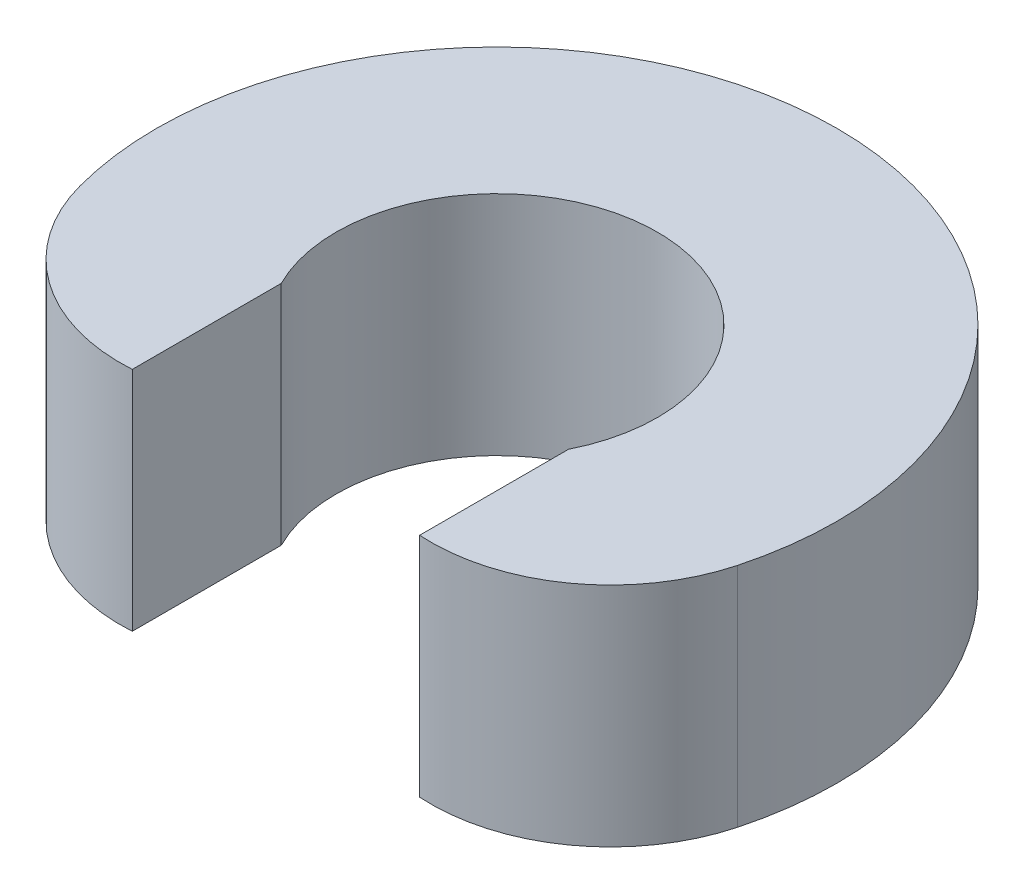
ISO-10303-21;
HEADER;
FILE_DESCRIPTION(('STEP AP214'),'2;1');
FILE_NAME('part.step','',(''),(''),'','','');
FILE_SCHEMA(('AUTOMOTIVE_DESIGN { 1 0 10303 214 1 1 1 1 }'));
ENDSEC;
DATA;
#1=APPLICATION_CONTEXT('core data for automotive mechanical design processes');
#2=APPLICATION_PROTOCOL_DEFINITION('international standard','automotive_design',2000,#1);
#3=PRODUCT_CONTEXT('',#1,'mechanical');
#4=PRODUCT('Part','Part','',(#3));
#5=PRODUCT_RELATED_PRODUCT_CATEGORY('part','',(#4));
#6=PRODUCT_DEFINITION_FORMATION('','',#4);
#7=PRODUCT_DEFINITION_CONTEXT('part definition',#1,'design');
#8=PRODUCT_DEFINITION('design','',#6,#7);
#9=PRODUCT_DEFINITION_SHAPE('','',#8);
#10=(LENGTH_UNIT() NAMED_UNIT(*) SI_UNIT(.MILLI.,.METRE.));
#11=(NAMED_UNIT(*) PLANE_ANGLE_UNIT() SI_UNIT($,.RADIAN.));
#12=(NAMED_UNIT(*) SI_UNIT($,.STERADIAN.) SOLID_ANGLE_UNIT());
#13=UNCERTAINTY_MEASURE_WITH_UNIT(LENGTH_MEASURE(1.E-05),#10,'distance_accuracy_value','');
#14=(GEOMETRIC_REPRESENTATION_CONTEXT(3) GLOBAL_UNCERTAINTY_ASSIGNED_CONTEXT((#13)) GLOBAL_UNIT_ASSIGNED_CONTEXT((#10,
#11,#12)) REPRESENTATION_CONTEXT('',''));
#15=CARTESIAN_POINT('',(0.,0.,0.));
#16=DIRECTION('',(0.,0.,1.));
#17=DIRECTION('',(1.,0.,0.));
#18=AXIS2_PLACEMENT_3D('',#15,#16,#17);
#19=CARTESIAN_POINT('',(190.,300.,400.));
#20=DIRECTION('',(-1.,0.,0.));
#21=DIRECTION('',(0.,0.,1.));
#22=AXIS2_PLACEMENT_3D('',#19,#20,#21);
#23=PLANE('',#22);
#24=DIRECTION('',(0.,1.,0.));
#25=VECTOR('',#24,1.);
#26=CARTESIAN_POINT('',(190.,300.,292.034677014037));
#27=LINE('',#26,#25);
#28=CARTESIAN_POINT('',(190.,0.,292.034677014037));
#29=VERTEX_POINT('',#28);
#30=CARTESIAN_POINT('',(190.,300.,292.034677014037));
#31=VERTEX_POINT('',#30);
#32=EDGE_CURVE('E10',#29,#31,#27,.T.);
#33=ORIENTED_EDGE('',*,*,#32,.T.);
#34=DIRECTION('',(0.,0.,-1.));
#35=VECTOR('',#34,1.);
#36=CARTESIAN_POINT('',(190.,300.,400.));
#37=LINE('',#36,#35);
#38=CARTESIAN_POINT('',(190.,300.,95.0973233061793));
#39=VERTEX_POINT('',#38);
#40=EDGE_CURVE('E19',#31,#39,#37,.T.);
#41=ORIENTED_EDGE('',*,*,#40,.T.);
#42=DIRECTION('',(0.,1.,0.));
#43=VECTOR('',#42,1.);
#44=CARTESIAN_POINT('',(190.,300.,95.0973233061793));
#45=LINE('',#44,#43);
#46=CARTESIAN_POINT('',(190.,0.,95.0973233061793));
#47=VERTEX_POINT('',#46);
#48=EDGE_CURVE('E139',#47,#39,#45,.T.);
#49=ORIENTED_EDGE('',*,*,#48,.F.);
#50=DIRECTION('',(0.,0.,-1.));
#51=VECTOR('',#50,1.);
#52=CARTESIAN_POINT('',(190.,0.,400.));
#53=LINE('',#52,#51);
#54=EDGE_CURVE('E123',#29,#47,#53,.T.);
#55=ORIENTED_EDGE('',*,*,#54,.F.);
#56=EDGE_LOOP('',(#33,#41,#49,#55));
#57=FACE_BOUND('',#56,.T.);
#58=ADVANCED_FACE('F15',(#57),#23,.T.);
#59=CARTESIAN_POINT('',(-190.,300.,0.));
#60=DIRECTION('',(1.,0.,0.));
#61=DIRECTION('',(0.,1.,0.));
#62=AXIS2_PLACEMENT_3D('',#59,#60,#61);
#63=PLANE('',#62);
#64=DIRECTION('',(0.,-1.,0.));
#65=VECTOR('',#64,1.);
#66=CARTESIAN_POINT('',(-190.,300.,292.034677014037));
#67=LINE('',#66,#65);
#68=CARTESIAN_POINT('',(-190.,300.,292.034677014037));
#69=VERTEX_POINT('',#68);
#70=CARTESIAN_POINT('',(-190.,0.,292.034677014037));
#71=VERTEX_POINT('',#70);
#72=EDGE_CURVE('E106',#69,#71,#67,.T.);
#73=ORIENTED_EDGE('',*,*,#72,.T.);
#74=DIRECTION('',(0.,0.,1.));
#75=VECTOR('',#74,1.);
#76=CARTESIAN_POINT('',(-190.,0.,0.));
#77=LINE('',#76,#75);
#78=CARTESIAN_POINT('',(-190.,0.,95.0973233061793));
#79=VERTEX_POINT('',#78);
#80=EDGE_CURVE('E83',#79,#71,#77,.T.);
#81=ORIENTED_EDGE('',*,*,#80,.F.);
#82=DIRECTION('',(0.,-1.,0.));
#83=VECTOR('',#82,1.);
#84=CARTESIAN_POINT('',(-190.,300.,95.0973233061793));
#85=LINE('',#84,#83);
#86=CARTESIAN_POINT('',(-190.,300.,95.0973233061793));
#87=VERTEX_POINT('',#86);
#88=EDGE_CURVE('E130',#87,#79,#85,.T.);
#89=ORIENTED_EDGE('',*,*,#88,.F.);
#90=DIRECTION('',(0.,0.,1.));
#91=VECTOR('',#90,1.);
#92=CARTESIAN_POINT('',(-190.,300.,0.));
#93=LINE('',#92,#91);
#94=EDGE_CURVE('E109',#87,#69,#93,.T.);
#95=ORIENTED_EDGE('',*,*,#94,.T.);
#96=EDGE_LOOP('',(#73,#81,#89,#95));
#97=FACE_BOUND('',#96,.T.);
#98=ADVANCED_FACE('F157',(#97),#63,.T.);
#99=CARTESIAN_POINT('',(0.,300.,1.38777878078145E-13));
#100=DIRECTION('',(0.,1.,0.));
#101=DIRECTION('',(0.,0.,-1.));
#102=AXIS2_PLACEMENT_3D('',#99,#100,#101);
#103=CYLINDRICAL_SURFACE('',#102,450.);
#104=CARTESIAN_POINT('',(0.,0.,1.38777878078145E-13));
#105=DIRECTION('',(0.,1.,0.));
#106=DIRECTION('',(1.,0.,0.));
#107=AXIS2_PLACEMENT_3D('',#104,#105,#106);
#108=CIRCLE('',#107,450.);
#109=CARTESIAN_POINT('',(434.666621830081,0.,116.468570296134));
#110=VERTEX_POINT('',#109);
#111=CARTESIAN_POINT('',(-434.666621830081,0.,116.468570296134));
#112=VERTEX_POINT('',#111);
#113=EDGE_CURVE('E93',#110,#112,#108,.T.);
#114=ORIENTED_EDGE('',*,*,#113,.T.);
#115=DIRECTION('',(0.,-1.,0.));
#116=VECTOR('',#115,1.);
#117=CARTESIAN_POINT('',(-434.666621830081,300.,116.468570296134));
#118=LINE('',#117,#116);
#119=CARTESIAN_POINT('',(-434.666621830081,300.,116.468570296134));
#120=VERTEX_POINT('',#119);
#121=EDGE_CURVE('E79',#120,#112,#118,.T.);
#122=ORIENTED_EDGE('',*,*,#121,.F.);
#123=CARTESIAN_POINT('',(0.,300.,1.38777878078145E-13));
#124=DIRECTION('',(0.,1.,0.));
#125=DIRECTION('',(1.,0.,0.));
#126=AXIS2_PLACEMENT_3D('',#123,#124,#125);
#127=CIRCLE('',#126,450.);
#128=CARTESIAN_POINT('',(434.666621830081,300.,116.468570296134));
#129=VERTEX_POINT('',#128);
#130=EDGE_CURVE('E69',#129,#120,#127,.T.);
#131=ORIENTED_EDGE('',*,*,#130,.F.);
#132=DIRECTION('',(0.,-1.,0.));
#133=VECTOR('',#132,1.);
#134=CARTESIAN_POINT('',(434.666621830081,300.,116.468570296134));
#135=LINE('',#134,#133);
#136=EDGE_CURVE('E77',#129,#110,#135,.T.);
#137=ORIENTED_EDGE('',*,*,#136,.T.);
#138=EDGE_LOOP('',(#114,#122,#131,#137));
#139=FACE_BOUND('',#138,.T.);
#140=ADVANCED_FACE('F76',(#139),#103,.T.);
#141=CARTESIAN_POINT('',(205.227652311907,300.,54.9905837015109));
#142=DIRECTION('',(0.,1.,0.));
#143=DIRECTION('',(0.,0.,-1.));
#144=AXIS2_PLACEMENT_3D('',#141,#142,#143);
#145=CYLINDRICAL_SURFACE('',#144,237.5327);
#146=ORIENTED_EDGE('',*,*,#32,.F.);
#147=CARTESIAN_POINT('',(205.227652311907,0.,54.9905837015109));
#148=DIRECTION('',(0.,1.,0.));
#149=DIRECTION('',(1.,0.,0.));
#150=AXIS2_PLACEMENT_3D('',#147,#148,#149);
#151=CIRCLE('',#150,237.5327);
#152=EDGE_CURVE('E91',#29,#110,#151,.T.);
#153=ORIENTED_EDGE('',*,*,#152,.T.);
#154=ORIENTED_EDGE('',*,*,#136,.F.);
#155=CARTESIAN_POINT('',(205.227652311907,300.,54.9905837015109));
#156=DIRECTION('',(0.,1.,0.));
#157=DIRECTION('',(1.,0.,0.));
#158=AXIS2_PLACEMENT_3D('',#155,#156,#157);
#159=CIRCLE('',#158,237.5327);
#160=EDGE_CURVE('E82',#31,#129,#159,.T.);
#161=ORIENTED_EDGE('',*,*,#160,.F.);
#162=EDGE_LOOP('',(#146,#153,#154,#161));
#163=FACE_BOUND('',#162,.T.);
#164=ADVANCED_FACE('F89',(#163),#145,.T.);
#165=CARTESIAN_POINT('',(-205.227652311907,300.,54.9905837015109));
#166=DIRECTION('',(0.,1.,0.));
#167=DIRECTION('',(0.,0.,-1.));
#168=AXIS2_PLACEMENT_3D('',#165,#166,#167);
#169=CYLINDRICAL_SURFACE('',#168,237.5327);
#170=ORIENTED_EDGE('',*,*,#72,.F.);
#171=CARTESIAN_POINT('',(-205.227652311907,300.,54.9905837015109));
#172=DIRECTION('',(0.,1.,0.));
#173=DIRECTION('',(1.,0.,0.));
#174=AXIS2_PLACEMENT_3D('',#171,#172,#173);
#175=CIRCLE('',#174,237.5327);
#176=EDGE_CURVE('E97',#120,#69,#175,.T.);
#177=ORIENTED_EDGE('',*,*,#176,.F.);
#178=ORIENTED_EDGE('',*,*,#121,.T.);
#179=CARTESIAN_POINT('',(-205.227652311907,0.,54.9905837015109));
#180=DIRECTION('',(0.,1.,0.));
#181=DIRECTION('',(1.,0.,0.));
#182=AXIS2_PLACEMENT_3D('',#179,#180,#181);
#183=CIRCLE('',#182,237.5327);
#184=EDGE_CURVE('E102',#112,#71,#183,.T.);
#185=ORIENTED_EDGE('',*,*,#184,.T.);
#186=EDGE_LOOP('',(#170,#177,#178,#185));
#187=FACE_BOUND('',#186,.T.);
#188=ADVANCED_FACE('F17',(#187),#169,.T.);
#189=CARTESIAN_POINT('',(102.613826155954,300.,27.4952918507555));
#190=DIRECTION('',(0.,1.,0.));
#191=DIRECTION('',(1.,0.,0.));
#192=AXIS2_PLACEMENT_3D('',#189,#190,#191);
#193=PLANE('',#192);
#194=ORIENTED_EDGE('',*,*,#176,.T.);
#195=ORIENTED_EDGE('',*,*,#94,.F.);
#196=CARTESIAN_POINT('',(0.,300.,0.));
#197=DIRECTION('',(0.,1.,0.));
#198=DIRECTION('',(1.,0.,0.));
#199=AXIS2_PLACEMENT_3D('',#196,#197,#198);
#200=CIRCLE('',#199,212.47);
#201=EDGE_CURVE('E126',#39,#87,#200,.T.);
#202=ORIENTED_EDGE('',*,*,#201,.F.);
#203=ORIENTED_EDGE('',*,*,#40,.F.);
#204=ORIENTED_EDGE('',*,*,#160,.T.);
#205=ORIENTED_EDGE('',*,*,#130,.T.);
#206=EDGE_LOOP('',(#194,#195,#202,#203,#204,#205));
#207=FACE_BOUND('',#206,.T.);
#208=ADVANCED_FACE('F95',(#207),#193,.T.);
#209=CARTESIAN_POINT('',(102.613826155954,0.,27.4952918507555));
#210=DIRECTION('',(0.,1.,0.));
#211=DIRECTION('',(1.,0.,0.));
#212=AXIS2_PLACEMENT_3D('',#209,#210,#211);
#213=PLANE('',#212);
#214=ORIENTED_EDGE('',*,*,#80,.T.);
#215=ORIENTED_EDGE('',*,*,#184,.F.);
#216=ORIENTED_EDGE('',*,*,#113,.F.);
#217=ORIENTED_EDGE('',*,*,#152,.F.);
#218=ORIENTED_EDGE('',*,*,#54,.T.);
#219=CARTESIAN_POINT('',(0.,0.,0.));
#220=DIRECTION('',(0.,-1.,0.));
#221=DIRECTION('',(0.,0.,1.));
#222=AXIS2_PLACEMENT_3D('',#219,#220,#221);
#223=CIRCLE('',#222,212.47);
#224=EDGE_CURVE('E133',#79,#47,#223,.T.);
#225=ORIENTED_EDGE('',*,*,#224,.F.);
#226=EDGE_LOOP('',(#214,#215,#216,#217,#218,#225));
#227=FACE_BOUND('',#226,.T.);
#228=ADVANCED_FACE('F166',(#227),#213,.F.);
#229=CARTESIAN_POINT('',(0.,300.,0.));
#230=DIRECTION('',(0.,1.,0.));
#231=DIRECTION('',(0.,0.,-1.));
#232=AXIS2_PLACEMENT_3D('',#229,#230,#231);
#233=CYLINDRICAL_SURFACE('',#232,212.47);
#234=ORIENTED_EDGE('',*,*,#201,.T.);
#235=ORIENTED_EDGE('',*,*,#88,.T.);
#236=ORIENTED_EDGE('',*,*,#224,.T.);
#237=ORIENTED_EDGE('',*,*,#48,.T.);
#238=EDGE_LOOP('',(#234,#235,#236,#237));
#239=FACE_BOUND('',#238,.T.);
#240=ADVANCED_FACE('F149',(#239),#233,.F.);
#241=CLOSED_SHELL('',(#58,#98,#140,#164,#188,#208,#228,#240));
#242=MANIFOLD_SOLID_BREP('B1',#241);
#243=ADVANCED_BREP_SHAPE_REPRESENTATION('',(#18,#242),#14);
#244=SHAPE_DEFINITION_REPRESENTATION(#9,#243);
ENDSEC;
END-ISO-10303-21;
